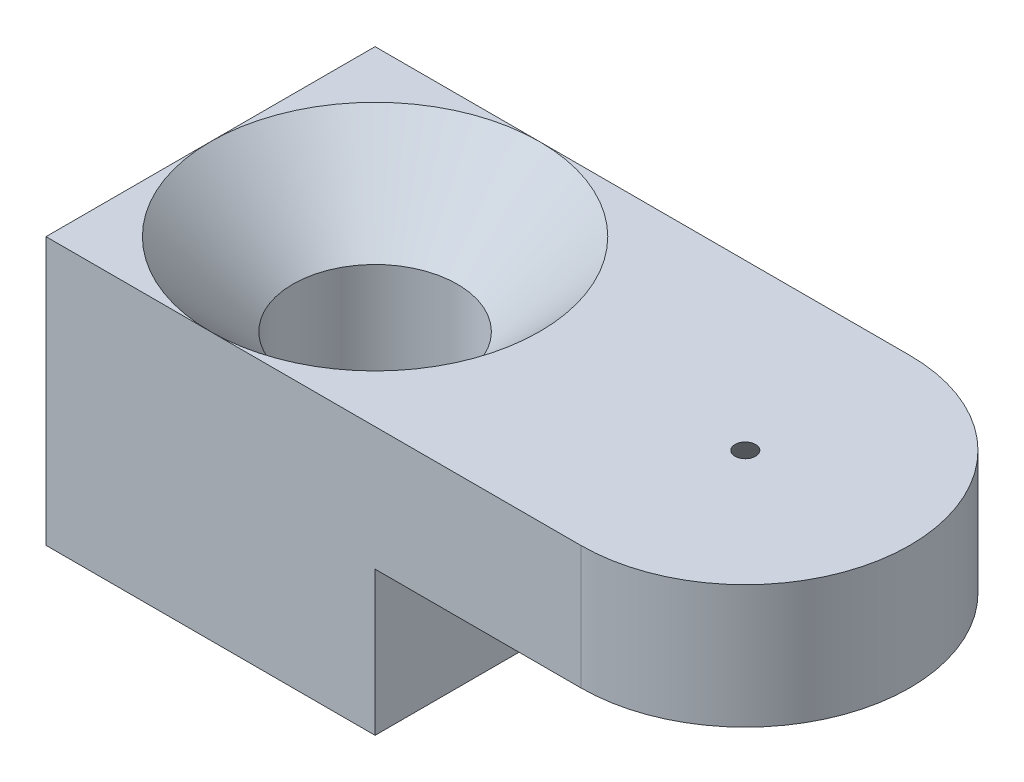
ISO-10303-21;
HEADER;
FILE_DESCRIPTION(('STEP AP214'),'2;1');
FILE_NAME('part.step','',(''),(''),'','','');
FILE_SCHEMA(('AUTOMOTIVE_DESIGN { 1 0 10303 214 1 1 1 1 }'));
ENDSEC;
DATA;
#1=APPLICATION_CONTEXT('core data for automotive mechanical design processes');
#2=APPLICATION_PROTOCOL_DEFINITION('international standard','automotive_design',2000,#1);
#3=PRODUCT_CONTEXT('',#1,'mechanical');
#4=PRODUCT('Part','Part','',(#3));
#5=PRODUCT_RELATED_PRODUCT_CATEGORY('part','',(#4));
#6=PRODUCT_DEFINITION_FORMATION('','',#4);
#7=PRODUCT_DEFINITION_CONTEXT('part definition',#1,'design');
#8=PRODUCT_DEFINITION('design','',#6,#7);
#9=PRODUCT_DEFINITION_SHAPE('','',#8);
#10=(LENGTH_UNIT() NAMED_UNIT(*) SI_UNIT(.MILLI.,.METRE.));
#11=(NAMED_UNIT(*) PLANE_ANGLE_UNIT() SI_UNIT($,.RADIAN.));
#12=(NAMED_UNIT(*) SI_UNIT($,.STERADIAN.) SOLID_ANGLE_UNIT());
#13=UNCERTAINTY_MEASURE_WITH_UNIT(LENGTH_MEASURE(1.E-05),#10,'distance_accuracy_value','');
#14=(GEOMETRIC_REPRESENTATION_CONTEXT(3) GLOBAL_UNCERTAINTY_ASSIGNED_CONTEXT((#13)) GLOBAL_UNIT_ASSIGNED_CONTEXT((#10,
#11,#12)) REPRESENTATION_CONTEXT('',''));
#15=CARTESIAN_POINT('',(0.,0.,0.));
#16=DIRECTION('',(0.,0.,1.));
#17=DIRECTION('',(1.,0.,0.));
#18=AXIS2_PLACEMENT_3D('',#15,#16,#17);
#19=CARTESIAN_POINT('',(0.,0.,-4.));
#20=DIRECTION('',(0.,0.,-1.));
#21=DIRECTION('',(-1.,0.,0.));
#22=AXIS2_PLACEMENT_3D('',#19,#20,#21);
#23=PLANE('',#22);
#24=DIRECTION('',(-1.,0.,0.));
#25=VECTOR('',#24,1.);
#26=CARTESIAN_POINT('',(4.1,3.,-4.));
#27=LINE('',#26,#25);
#28=CARTESIAN_POINT('',(0.,3.,-4.));
#29=VERTEX_POINT('',#28);
#30=CARTESIAN_POINT('',(-9.,3.,-4.));
#31=VERTEX_POINT('',#30);
#32=EDGE_CURVE('E53',#29,#31,#27,.T.);
#33=ORIENTED_EDGE('',*,*,#32,.F.);
#34=DIRECTION('',(0.,1.,0.));
#35=VECTOR('',#34,1.);
#36=CARTESIAN_POINT('',(0.,-3.5,-4.));
#37=LINE('',#36,#35);
#38=CARTESIAN_POINT('',(0.,0.,-4.));
#39=VERTEX_POINT('',#38);
#40=EDGE_CURVE('E92',#39,#29,#37,.T.);
#41=ORIENTED_EDGE('',*,*,#40,.F.);
#42=DIRECTION('',(1.,0.,0.));
#43=VECTOR('',#42,1.);
#44=CARTESIAN_POINT('',(-5.,0.,-4.));
#45=LINE('',#44,#43);
#46=CARTESIAN_POINT('',(-5.,0.,-4.));
#47=VERTEX_POINT('',#46);
#48=EDGE_CURVE('E113',#47,#39,#45,.T.);
#49=ORIENTED_EDGE('',*,*,#48,.F.);
#50=DIRECTION('',(0.,1.,0.));
#51=VECTOR('',#50,1.);
#52=CARTESIAN_POINT('',(-5.,-3.5,-4.));
#53=LINE('',#52,#51);
#54=CARTESIAN_POINT('',(-5.,-3.5,-4.));
#55=VERTEX_POINT('',#54);
#56=EDGE_CURVE('E163',#55,#47,#53,.T.);
#57=ORIENTED_EDGE('',*,*,#56,.F.);
#58=DIRECTION('',(1.,0.,0.));
#59=VECTOR('',#58,1.);
#60=CARTESIAN_POINT('',(-13.,-3.5,-4.));
#61=LINE('',#60,#59);
#62=CARTESIAN_POINT('',(-13.,-3.5,-4.));
#63=VERTEX_POINT('',#62);
#64=EDGE_CURVE('E111',#63,#55,#61,.T.);
#65=ORIENTED_EDGE('',*,*,#64,.F.);
#66=DIRECTION('',(0.,-1.,0.));
#67=VECTOR('',#66,1.);
#68=CARTESIAN_POINT('',(-13.,3.,-4.));
#69=LINE('',#68,#67);
#70=CARTESIAN_POINT('',(-13.,3.,-4.));
#71=VERTEX_POINT('',#70);
#72=EDGE_CURVE('E108',#71,#63,#69,.T.);
#73=ORIENTED_EDGE('',*,*,#72,.F.);
#74=EDGE_CURVE('E107',#31,#71,#27,.T.);
#75=ORIENTED_EDGE('',*,*,#74,.F.);
#76=EDGE_LOOP('',(#33,#41,#49,#57,#65,#73,#75));
#77=FACE_BOUND('',#76,.T.);
#78=ADVANCED_FACE('F32',(#77),#23,.T.);
#79=CARTESIAN_POINT('',(0.,0.,4.));
#80=DIRECTION('',(0.,0.,-1.));
#81=DIRECTION('',(-1.,0.,0.));
#82=AXIS2_PLACEMENT_3D('',#79,#80,#81);
#83=PLANE('',#82);
#84=DIRECTION('',(0.,1.,0.));
#85=VECTOR('',#84,1.);
#86=CARTESIAN_POINT('',(0.,-3.5,4.));
#87=LINE('',#86,#85);
#88=CARTESIAN_POINT('',(0.,3.,4.));
#89=VERTEX_POINT('',#88);
#90=CARTESIAN_POINT('',(0.,0.,4.));
#91=VERTEX_POINT('',#90);
#92=EDGE_CURVE('E11',#89,#91,#87,.F.);
#93=ORIENTED_EDGE('',*,*,#92,.F.);
#94=DIRECTION('',(-1.,0.,0.));
#95=VECTOR('',#94,1.);
#96=CARTESIAN_POINT('',(4.1,3.,4.));
#97=LINE('',#96,#95);
#98=CARTESIAN_POINT('',(-9.,3.,4.));
#99=VERTEX_POINT('',#98);
#100=EDGE_CURVE('E103',#89,#99,#97,.T.);
#101=ORIENTED_EDGE('',*,*,#100,.T.);
#102=CARTESIAN_POINT('',(-13.,3.,4.));
#103=VERTEX_POINT('',#102);
#104=EDGE_CURVE('E146',#99,#103,#97,.T.);
#105=ORIENTED_EDGE('',*,*,#104,.T.);
#106=DIRECTION('',(0.,-1.,0.));
#107=VECTOR('',#106,1.);
#108=CARTESIAN_POINT('',(-13.,3.,4.));
#109=LINE('',#108,#107);
#110=CARTESIAN_POINT('',(-13.,-3.5,4.));
#111=VERTEX_POINT('',#110);
#112=EDGE_CURVE('E154',#103,#111,#109,.T.);
#113=ORIENTED_EDGE('',*,*,#112,.T.);
#114=DIRECTION('',(1.,0.,0.));
#115=VECTOR('',#114,1.);
#116=CARTESIAN_POINT('',(-13.,-3.5,4.));
#117=LINE('',#116,#115);
#118=CARTESIAN_POINT('',(-5.,-3.5,4.));
#119=VERTEX_POINT('',#118);
#120=EDGE_CURVE('E161',#111,#119,#117,.T.);
#121=ORIENTED_EDGE('',*,*,#120,.T.);
#122=DIRECTION('',(0.,1.,0.));
#123=VECTOR('',#122,1.);
#124=CARTESIAN_POINT('',(-5.,-3.5,4.));
#125=LINE('',#124,#123);
#126=CARTESIAN_POINT('',(-5.,0.,4.));
#127=VERTEX_POINT('',#126);
#128=EDGE_CURVE('E156',#119,#127,#125,.T.);
#129=ORIENTED_EDGE('',*,*,#128,.T.);
#130=DIRECTION('',(1.,0.,0.));
#131=VECTOR('',#130,1.);
#132=CARTESIAN_POINT('',(-5.,0.,4.));
#133=LINE('',#132,#131);
#134=EDGE_CURVE('E152',#127,#91,#133,.T.);
#135=ORIENTED_EDGE('',*,*,#134,.T.);
#136=EDGE_LOOP('',(#93,#101,#105,#113,#121,#129,#135));
#137=FACE_BOUND('',#136,.T.);
#138=ADVANCED_FACE('F177',(#137),#83,.F.);
#139=CARTESIAN_POINT('',(4.1,3.,-4.));
#140=DIRECTION('',(0.,1.,0.));
#141=DIRECTION('',(-1.,0.,0.));
#142=AXIS2_PLACEMENT_3D('',#139,#140,#141);
#143=PLANE('',#142);
#144=DIRECTION('',(0.,0.,1.));
#145=VECTOR('',#144,1.);
#146=CARTESIAN_POINT('',(-13.,3.,-4.));
#147=LINE('',#146,#145);
#148=CARTESIAN_POINT('',(-13.,3.,0.));
#149=VERTEX_POINT('',#148);
#150=EDGE_CURVE('E125',#71,#149,#147,.T.);
#151=ORIENTED_EDGE('',*,*,#150,.T.);
#152=CARTESIAN_POINT('',(-9.,3.,0.));
#153=DIRECTION('',(0.,1.,0.));
#154=DIRECTION('',(-1.,0.,0.));
#155=AXIS2_PLACEMENT_3D('',#152,#153,#154);
#156=CIRCLE('',#155,4.00000000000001);
#157=EDGE_CURVE('E40',#149,#31,#156,.F.);
#158=ORIENTED_EDGE('',*,*,#157,.T.);
#159=ORIENTED_EDGE('',*,*,#74,.T.);
#160=EDGE_LOOP('',(#151,#158,#159));
#161=FACE_BOUND('',#160,.T.);
#162=ADVANCED_FACE('F138',(#161),#143,.T.);
#163=CARTESIAN_POINT('',(0.,3.,0.));
#164=DIRECTION('',(0.,-1.,0.));
#165=DIRECTION('',(-1.,0.,0.));
#166=AXIS2_PLACEMENT_3D('',#163,#164,#165);
#167=CIRCLE('',#166,4.);
#168=EDGE_CURVE('E46',#29,#89,#167,.T.);
#169=ORIENTED_EDGE('',*,*,#168,.F.);
#170=ORIENTED_EDGE('',*,*,#32,.T.);
#171=CARTESIAN_POINT('',(-9.,3.,0.));
#172=DIRECTION('',(0.,1.,0.));
#173=DIRECTION('',(-1.,0.,0.));
#174=AXIS2_PLACEMENT_3D('',#171,#172,#173);
#175=CIRCLE('',#174,4.00000000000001);
#176=EDGE_CURVE('E134',#31,#99,#175,.F.);
#177=ORIENTED_EDGE('',*,*,#176,.T.);
#178=ORIENTED_EDGE('',*,*,#100,.F.);
#179=EDGE_LOOP('',(#169,#170,#177,#178));
#180=FACE_BOUND('',#179,.T.);
#181=CARTESIAN_POINT('',(0.,3.,0.));
#182=DIRECTION('',(0.,-1.,0.));
#183=DIRECTION('',(0.,0.,-1.));
#184=AXIS2_PLACEMENT_3D('',#181,#182,#183);
#185=CIRCLE('',#184,0.249999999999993);
#186=CARTESIAN_POINT('',(0.,3.,-0.249999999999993));
#187=VERTEX_POINT('',#186);
#188=EDGE_CURVE('E188',#187,#187,#185,.T.);
#189=ORIENTED_EDGE('',*,*,#188,.T.);
#190=EDGE_LOOP('',(#189));
#191=FACE_BOUND('',#190,.T.);
#192=ADVANCED_FACE('F101',(#180,#191),#143,.T.);
#193=CARTESIAN_POINT('',(-5.,-3.5,-4.));
#194=DIRECTION('',(1.,0.,0.));
#195=DIRECTION('',(0.,0.,-1.));
#196=AXIS2_PLACEMENT_3D('',#193,#194,#195);
#197=PLANE('',#196);
#198=DIRECTION('',(0.,0.,1.));
#199=VECTOR('',#198,1.);
#200=CARTESIAN_POINT('',(-5.,0.,-4.));
#201=LINE('',#200,#199);
#202=EDGE_CURVE('E119',#47,#127,#201,.T.);
#203=ORIENTED_EDGE('',*,*,#202,.T.);
#204=ORIENTED_EDGE('',*,*,#128,.F.);
#205=DIRECTION('',(0.,0.,1.));
#206=VECTOR('',#205,1.);
#207=CARTESIAN_POINT('',(-5.,-3.5,-4.));
#208=LINE('',#207,#206);
#209=EDGE_CURVE('E120',#55,#119,#208,.T.);
#210=ORIENTED_EDGE('',*,*,#209,.F.);
#211=ORIENTED_EDGE('',*,*,#56,.T.);
#212=EDGE_LOOP('',(#203,#204,#210,#211));
#213=FACE_BOUND('',#212,.T.);
#214=ADVANCED_FACE('F180',(#213),#197,.T.);
#215=CARTESIAN_POINT('',(-13.,-3.5,-4.));
#216=DIRECTION('',(0.,-1.,0.));
#217=DIRECTION('',(0.,0.,-1.));
#218=AXIS2_PLACEMENT_3D('',#215,#216,#217);
#219=PLANE('',#218);
#220=CARTESIAN_POINT('',(-9.,-3.5,0.));
#221=DIRECTION('',(0.,1.,0.));
#222=DIRECTION('',(-1.,0.,0.));
#223=AXIS2_PLACEMENT_3D('',#220,#221,#222);
#224=CIRCLE('',#223,2.);
#225=CARTESIAN_POINT('',(-11.,-3.5,0.));
#226=VERTEX_POINT('',#225);
#227=EDGE_CURVE('E191',#226,#226,#224,.T.);
#228=ORIENTED_EDGE('',*,*,#227,.T.);
#229=EDGE_LOOP('',(#228));
#230=FACE_BOUND('',#229,.T.);
#231=ORIENTED_EDGE('',*,*,#209,.T.);
#232=ORIENTED_EDGE('',*,*,#120,.F.);
#233=DIRECTION('',(0.,0.,1.));
#234=VECTOR('',#233,1.);
#235=CARTESIAN_POINT('',(-13.,-3.5,-4.));
#236=LINE('',#235,#234);
#237=EDGE_CURVE('E123',#63,#111,#236,.T.);
#238=ORIENTED_EDGE('',*,*,#237,.F.);
#239=ORIENTED_EDGE('',*,*,#64,.T.);
#240=EDGE_LOOP('',(#231,#232,#238,#239));
#241=FACE_BOUND('',#240,.T.);
#242=ADVANCED_FACE('F173',(#230,#241),#219,.T.);
#243=CARTESIAN_POINT('',(-13.,3.,-4.));
#244=DIRECTION('',(-1.,0.,0.));
#245=DIRECTION('',(0.,0.,1.));
#246=AXIS2_PLACEMENT_3D('',#243,#244,#245);
#247=PLANE('',#246);
#248=ORIENTED_EDGE('',*,*,#237,.T.);
#249=ORIENTED_EDGE('',*,*,#112,.F.);
#250=EDGE_CURVE('E128',#149,#103,#147,.T.);
#251=ORIENTED_EDGE('',*,*,#250,.F.);
#252=ORIENTED_EDGE('',*,*,#150,.F.);
#253=ORIENTED_EDGE('',*,*,#72,.T.);
#254=EDGE_LOOP('',(#248,#249,#251,#252,#253));
#255=FACE_BOUND('',#254,.T.);
#256=ADVANCED_FACE('F176',(#255),#247,.T.);
#257=ORIENTED_EDGE('',*,*,#104,.F.);
#258=CARTESIAN_POINT('',(-9.,3.,0.));
#259=DIRECTION('',(0.,1.,0.));
#260=DIRECTION('',(-1.,0.,0.));
#261=AXIS2_PLACEMENT_3D('',#258,#259,#260);
#262=CIRCLE('',#261,4.00000000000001);
#263=EDGE_CURVE('E132',#99,#149,#262,.F.);
#264=ORIENTED_EDGE('',*,*,#263,.T.);
#265=ORIENTED_EDGE('',*,*,#250,.T.);
#266=EDGE_LOOP('',(#257,#264,#265));
#267=FACE_BOUND('',#266,.T.);
#268=ADVANCED_FACE('F147',(#267),#143,.T.);
#269=CARTESIAN_POINT('',(-5.,0.,-4.));
#270=DIRECTION('',(0.,-1.,0.));
#271=DIRECTION('',(0.,0.,-1.));
#272=AXIS2_PLACEMENT_3D('',#269,#270,#271);
#273=PLANE('',#272);
#274=CARTESIAN_POINT('',(0.,0.,0.));
#275=DIRECTION('',(0.,-1.,0.));
#276=DIRECTION('',(0.,0.,-1.));
#277=AXIS2_PLACEMENT_3D('',#274,#275,#276);
#278=CIRCLE('',#277,4.);
#279=EDGE_CURVE('E95',#91,#39,#278,.F.);
#280=ORIENTED_EDGE('',*,*,#279,.F.);
#281=ORIENTED_EDGE('',*,*,#134,.F.);
#282=ORIENTED_EDGE('',*,*,#202,.F.);
#283=ORIENTED_EDGE('',*,*,#48,.T.);
#284=EDGE_LOOP('',(#280,#281,#282,#283));
#285=FACE_BOUND('',#284,.T.);
#286=CARTESIAN_POINT('',(0.,0.,0.));
#287=DIRECTION('',(0.,-1.,0.));
#288=DIRECTION('',(0.,0.,-1.));
#289=AXIS2_PLACEMENT_3D('',#286,#287,#288);
#290=CIRCLE('',#289,2.25);
#291=CARTESIAN_POINT('',(0.,0.,-2.25));
#292=VERTEX_POINT('',#291);
#293=EDGE_CURVE('E181',#292,#292,#290,.T.);
#294=ORIENTED_EDGE('',*,*,#293,.F.);
#295=EDGE_LOOP('',(#294));
#296=FACE_BOUND('',#295,.T.);
#297=ADVANCED_FACE('F168',(#285,#296),#273,.T.);
#298=CARTESIAN_POINT('',(0.,0.,0.));
#299=DIRECTION('',(0.,-1.,0.));
#300=DIRECTION('',(0.,0.,-1.));
#301=AXIS2_PLACEMENT_3D('',#298,#299,#300);
#302=CYLINDRICAL_SURFACE('',#301,2.25);
#303=CARTESIAN_POINT('',(0.,1.,0.));
#304=DIRECTION('',(0.,-1.,0.));
#305=DIRECTION('',(0.,0.,-1.));
#306=AXIS2_PLACEMENT_3D('',#303,#304,#305);
#307=CIRCLE('',#306,2.25);
#308=CARTESIAN_POINT('',(0.,1.,-2.25));
#309=VERTEX_POINT('',#308);
#310=EDGE_CURVE('E183',#309,#309,#307,.T.);
#311=ORIENTED_EDGE('',*,*,#310,.F.);
#312=EDGE_LOOP('',(#311));
#313=FACE_BOUND('',#312,.T.);
#314=ORIENTED_EDGE('',*,*,#293,.T.);
#315=EDGE_LOOP('',(#314));
#316=FACE_BOUND('',#315,.T.);
#317=ADVANCED_FACE('F206',(#313,#316),#302,.F.);
#318=CARTESIAN_POINT('',(0.,1.,0.));
#319=DIRECTION('',(0.,-1.,0.));
#320=DIRECTION('',(0.,0.,-1.));
#321=AXIS2_PLACEMENT_3D('',#318,#319,#320);
#322=CONICAL_SURFACE('',#321,2.25,0.78539816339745);
#323=CARTESIAN_POINT('',(0.,3.,-0.249999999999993));
#324=CARTESIAN_POINT('',(0.,2.97916666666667,-0.270833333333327));
#325=CARTESIAN_POINT('',(0.,2.95833333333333,-0.29166666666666));
#326=CARTESIAN_POINT('',(0.,2.91666666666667,-0.333333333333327));
#327=CARTESIAN_POINT('',(0.,2.89583333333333,-0.35416666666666));
#328=CARTESIAN_POINT('',(0.,2.85416666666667,-0.395833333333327));
#329=CARTESIAN_POINT('',(0.,2.83333333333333,-0.41666666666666));
#330=CARTESIAN_POINT('',(0.,2.79166666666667,-0.458333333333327));
#331=CARTESIAN_POINT('',(0.,2.77083333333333,-0.479166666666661));
#332=CARTESIAN_POINT('',(0.,2.72916666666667,-0.520833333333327));
#333=CARTESIAN_POINT('',(0.,2.70833333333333,-0.541666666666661));
#334=CARTESIAN_POINT('',(0.,2.66666666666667,-0.583333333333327));
#335=CARTESIAN_POINT('',(0.,2.64583333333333,-0.604166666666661));
#336=CARTESIAN_POINT('',(0.,2.60416666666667,-0.645833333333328));
#337=CARTESIAN_POINT('',(0.,2.58333333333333,-0.666666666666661));
#338=CARTESIAN_POINT('',(0.,2.54166666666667,-0.708333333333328));
#339=CARTESIAN_POINT('',(0.,2.52083333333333,-0.729166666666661));
#340=CARTESIAN_POINT('',(0.,2.47916666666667,-0.770833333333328));
#341=CARTESIAN_POINT('',(0.,2.45833333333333,-0.791666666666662));
#342=CARTESIAN_POINT('',(0.,2.41666666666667,-0.833333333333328));
#343=CARTESIAN_POINT('',(0.,2.39583333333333,-0.854166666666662));
#344=CARTESIAN_POINT('',(0.,2.35416666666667,-0.895833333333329));
#345=CARTESIAN_POINT('',(0.,2.33333333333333,-0.916666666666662));
#346=CARTESIAN_POINT('',(0.,2.29166666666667,-0.958333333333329));
#347=CARTESIAN_POINT('',(0.,2.27083333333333,-0.979166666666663));
#348=CARTESIAN_POINT('',(0.,2.22916666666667,-1.02083333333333));
#349=CARTESIAN_POINT('',(0.,2.20833333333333,-1.04166666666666));
#350=CARTESIAN_POINT('',(0.,2.16666666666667,-1.08333333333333));
#351=CARTESIAN_POINT('',(0.,2.14583333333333,-1.10416666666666));
#352=CARTESIAN_POINT('',(0.,2.10416666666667,-1.14583333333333));
#353=CARTESIAN_POINT('',(0.,2.08333333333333,-1.16666666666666));
#354=CARTESIAN_POINT('',(0.,2.04166666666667,-1.20833333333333));
#355=CARTESIAN_POINT('',(0.,2.02083333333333,-1.22916666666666));
#356=CARTESIAN_POINT('',(0.,1.97916666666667,-1.27083333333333));
#357=CARTESIAN_POINT('',(0.,1.95833333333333,-1.29166666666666));
#358=CARTESIAN_POINT('',(0.,1.91666666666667,-1.33333333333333));
#359=CARTESIAN_POINT('',(0.,1.89583333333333,-1.35416666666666));
#360=CARTESIAN_POINT('',(0.,1.85416666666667,-1.39583333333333));
#361=CARTESIAN_POINT('',(0.,1.83333333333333,-1.41666666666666));
#362=CARTESIAN_POINT('',(0.,1.79166666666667,-1.45833333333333));
#363=CARTESIAN_POINT('',(0.,1.77083333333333,-1.47916666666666));
#364=CARTESIAN_POINT('',(0.,1.72916666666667,-1.52083333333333));
#365=CARTESIAN_POINT('',(0.,1.70833333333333,-1.54166666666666));
#366=CARTESIAN_POINT('',(0.,1.66666666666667,-1.58333333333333));
#367=CARTESIAN_POINT('',(0.,1.64583333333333,-1.60416666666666));
#368=CARTESIAN_POINT('',(0.,1.60416666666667,-1.64583333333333));
#369=CARTESIAN_POINT('',(0.,1.58333333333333,-1.66666666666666));
#370=CARTESIAN_POINT('',(0.,1.54166666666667,-1.70833333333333));
#371=CARTESIAN_POINT('',(0.,1.52083333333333,-1.72916666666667));
#372=CARTESIAN_POINT('',(0.,1.47916666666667,-1.77083333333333));
#373=CARTESIAN_POINT('',(0.,1.45833333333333,-1.79166666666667));
#374=CARTESIAN_POINT('',(0.,1.41666666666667,-1.83333333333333));
#375=CARTESIAN_POINT('',(0.,1.39583333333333,-1.85416666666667));
#376=CARTESIAN_POINT('',(0.,1.35416666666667,-1.89583333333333));
#377=CARTESIAN_POINT('',(0.,1.33333333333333,-1.91666666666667));
#378=CARTESIAN_POINT('',(0.,1.29166666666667,-1.95833333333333));
#379=CARTESIAN_POINT('',(0.,1.27083333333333,-1.97916666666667));
#380=CARTESIAN_POINT('',(0.,1.22916666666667,-2.02083333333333));
#381=CARTESIAN_POINT('',(0.,1.20833333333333,-2.04166666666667));
#382=CARTESIAN_POINT('',(0.,1.16666666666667,-2.08333333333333));
#383=CARTESIAN_POINT('',(0.,1.14583333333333,-2.10416666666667));
#384=CARTESIAN_POINT('',(0.,1.10416666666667,-2.14583333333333));
#385=CARTESIAN_POINT('',(0.,1.08333333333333,-2.16666666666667));
#386=CARTESIAN_POINT('',(0.,1.04166666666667,-2.20833333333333));
#387=CARTESIAN_POINT('',(0.,1.02083333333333,-2.22916666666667));
#388=CARTESIAN_POINT('',(0.,1.,-2.25));
#389=B_SPLINE_CURVE_WITH_KNOTS('',3,(#323,#324,#325,#326,#327,#328,#329,#330,#331,#332,#333,
#334,#335,#336,#337,#338,#339,#340,#341,#342,#343,#344,#345,#346,#347,#348,#349,#350,#351,#352,
#353,#354,#355,#356,#357,#358,#359,#360,#361,#362,#363,#364,#365,#366,#367,#368,#369,#370,#371,
#372,#373,#374,#375,#376,#377,#378,#379,#380,#381,#382,#383,#384,#385,#386,#387,#388),
.UNSPECIFIED.,.F.,.F.,(4,2,2,2,2,2,2,2,2,2,2,2,2,2,2,2,2,2,2,2,2,2,2,2,2,2,2,2,2,2,2,2,4),(0.,
0.0883883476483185,0.176776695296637,0.265165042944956,0.353553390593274,0.441941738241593,
0.530330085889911,0.61871843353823,0.707106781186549,0.795495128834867,0.883883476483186,
0.972271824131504,1.06066017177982,1.14904851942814,1.23743686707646,1.32582521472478,
1.4142135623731,1.50260191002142,1.59099025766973,1.67937860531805,1.76776695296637,
1.85615530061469,1.94454364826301,2.03293199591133,2.12132034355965,2.20970869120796,
2.29809703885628,2.3864853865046,2.47487373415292,2.56326208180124,2.65165042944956,
2.74003877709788,2.8284271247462),.UNSPECIFIED.);
#390=EDGE_CURVE('BSEAM199',#187,#309,#389,.T.);
#391=ORIENTED_EDGE('',*,*,#188,.F.);
#392=ORIENTED_EDGE('',*,*,#310,.T.);
#393=ORIENTED_EDGE('',*,*,#390,.T.);
#394=ORIENTED_EDGE('',*,*,#390,.F.);
#395=EDGE_LOOP('',(#391,#393,#392,#394));
#396=FACE_BOUND('',#395,.T.);
#397=ADVANCED_FACE('F199',(#396),#322,.F.);
#398=CARTESIAN_POINT('',(-9.,-3.5,0.));
#399=DIRECTION('',(0.,1.,0.));
#400=DIRECTION('',(-1.,0.,0.));
#401=AXIS2_PLACEMENT_3D('',#398,#399,#400);
#402=CYLINDRICAL_SURFACE('',#401,2.);
#403=CARTESIAN_POINT('',(-9.,0.999999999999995,0.));
#404=DIRECTION('',(0.,1.,0.));
#405=DIRECTION('',(0.,0.,1.));
#406=AXIS2_PLACEMENT_3D('',#403,#404,#405);
#407=CIRCLE('',#406,2.);
#408=CARTESIAN_POINT('',(-9.,0.999999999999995,2.));
#409=VERTEX_POINT('',#408);
#410=EDGE_CURVE('E122',#409,#409,#407,.T.);
#411=ORIENTED_EDGE('',*,*,#410,.T.);
#412=EDGE_LOOP('',(#411));
#413=FACE_BOUND('',#412,.T.);
#414=ORIENTED_EDGE('',*,*,#227,.F.);
#415=EDGE_LOOP('',(#414));
#416=FACE_BOUND('',#415,.T.);
#417=ADVANCED_FACE('F197',(#413,#416),#402,.F.);
#418=CARTESIAN_POINT('',(-9.,0.999999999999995,0.));
#419=DIRECTION('',(0.,1.,0.));
#420=DIRECTION('',(0.,0.,1.));
#421=AXIS2_PLACEMENT_3D('',#418,#419,#420);
#422=CONICAL_SURFACE('',#421,2.,0.78539816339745);
#423=ORIENTED_EDGE('',*,*,#176,.F.);
#424=ORIENTED_EDGE('',*,*,#157,.F.);
#425=ORIENTED_EDGE('',*,*,#263,.F.);
#426=EDGE_LOOP('',(#423,#424,#425));
#427=FACE_BOUND('',#426,.T.);
#428=ORIENTED_EDGE('',*,*,#410,.F.);
#429=EDGE_LOOP('',(#428));
#430=FACE_BOUND('',#429,.T.);
#431=ADVANCED_FACE('F34',(#427,#430),#422,.F.);
#432=CARTESIAN_POINT('',(0.,-3.5,0.));
#433=DIRECTION('',(0.,1.,0.));
#434=DIRECTION('',(-1.,0.,0.));
#435=AXIS2_PLACEMENT_3D('',#432,#433,#434);
#436=CYLINDRICAL_SURFACE('',#435,4.);
#437=ORIENTED_EDGE('',*,*,#279,.T.);
#438=ORIENTED_EDGE('',*,*,#40,.T.);
#439=ORIENTED_EDGE('',*,*,#168,.T.);
#440=ORIENTED_EDGE('',*,*,#92,.T.);
#441=EDGE_LOOP('',(#437,#438,#439,#440));
#442=FACE_BOUND('',#441,.T.);
#443=ADVANCED_FACE('F93',(#442),#436,.T.);
#444=CLOSED_SHELL('',(#78,#138,#162,#192,#214,#242,#256,#268,#297,#317,#397,#417,#431,#443));
#445=MANIFOLD_SOLID_BREP('B2',#444);
#446=ADVANCED_BREP_SHAPE_REPRESENTATION('',(#18,#445),#14);
#447=SHAPE_DEFINITION_REPRESENTATION(#9,#446);
ENDSEC;
END-ISO-10303-21;
